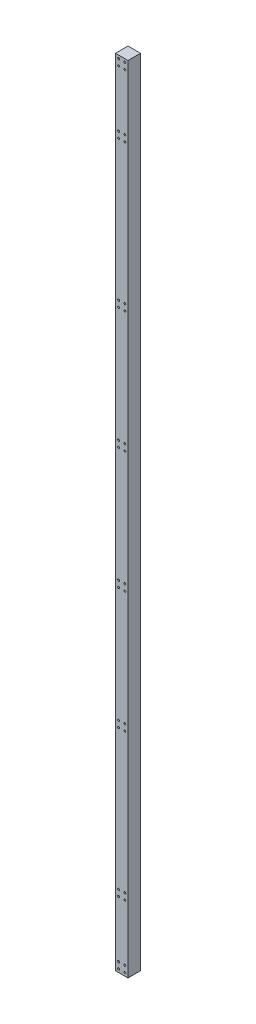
from build123d import *

# Parameters (mm, degrees)
SKETCH_1_W                   = 60
SKETCH_1_H                   = 60
EXTRUDE_1_DEPTH              = 3800
HOLE_WIZARD_M8_1_D           = 9
HOLE_WIZARD_M8_1_CBORE_D     = 15
HOLE_WIZARD_M8_1_CBORE_DEPTH = 6


with BuildPart() as part:
    # Sketch 1 → Extrude 1 (new body)
    with BuildSketch(Plane(origin=(0, 0, 0), x_dir=(1, 0, 0), z_dir=(0, 1, 0))):
        Rectangle(SKETCH_1_W, SKETCH_1_H)
    extrude(amount=EXTRUDE_1_DEPTH)

    # Hole Wizard M8 _1 (through all)
    with Locations(Plane(origin=(0, 0, -30), x_dir=(-1, 0, 0), z_dir=(0, 0, -1))):
        with Locations((15, 1015), (-15, 1015), (-15, 1045), (15, 1045), (15, 1595), (-15, 1595), (-15, 1625), (15, 1625), (15, 2175), (-15, 2175), (-15, 2205), (15, 2205), (15, 2755), (-15, 2755), (-15, 2785), (15, 2785), (-15, 15), (-15, 45), (15, 45), (15, 15), (-15, 315), (15, 315), (-15, 345), (15, 345), (-15, 3785), (15, 3785), (15, 3755), (-15, 3755), (-15, 3485), (15, 3485), (-15, 3455), (15, 3455)):
            CounterBoreHole(HOLE_WIZARD_M8_1_D / 2, HOLE_WIZARD_M8_1_CBORE_D / 2, HOLE_WIZARD_M8_1_CBORE_DEPTH)


solid = part.part
